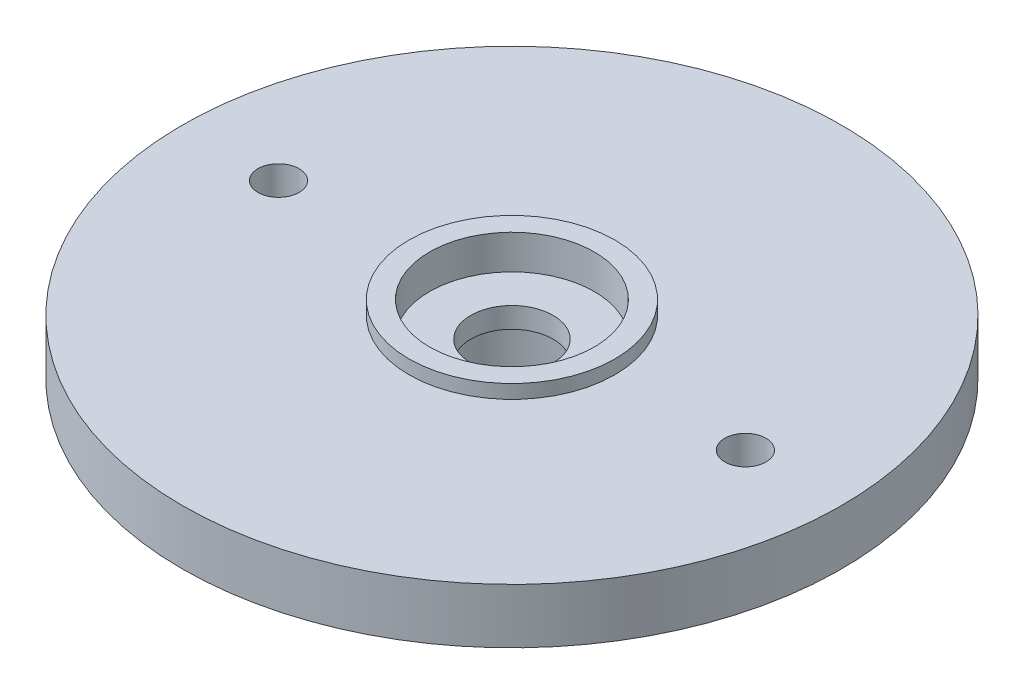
from build123d import *

# Parameters (mm, degrees)
SKICA2_R                 = 0.75
ODEBRAT_VYSUNUT_M1_DEPTH = 18.557049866


with BuildPart() as part:
    # Skica1 → Z_klad-Rota_n (revolve)
    with BuildSketch(Plane.XY, mode=Mode.PRIVATE) as z_klad_rota_n_sk:
        Polygon((3, 0), (4.5, 0), (4.5, 2.5), (12, 2.5), (12, 4.5), (3.75, 4.5), (3.75, 5), (3, 5), (3, 3.75), (1.5, 3.75), (1.5, 3), (3, 3), align=None)
    revolve(z_klad_rota_n_sk.sketch.rotate(Axis((0, 9.560859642, 0), (0, -1, 0)), 90), axis=Axis((0, 9.560859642, 0), (0, -1, 0)))

    # Skica2 → Odebrat vysunut_m1 (cut, through all)
    with BuildSketch(Plane(origin=(0, 4.5, 0), x_dir=(-1, 0, 0), z_dir=(0, 1, 0))):
        with Locations(Location((-8.5, 0, 0), (0, 0, 90))):
            Circle(SKICA2_R)
        with Locations(Location((8.5, 0, 0), (0, 0, 90))):
            Circle(SKICA2_R)
    extrude(amount=-ODEBRAT_VYSUNUT_M1_DEPTH, mode=Mode.SUBTRACT)


solid = part.part
